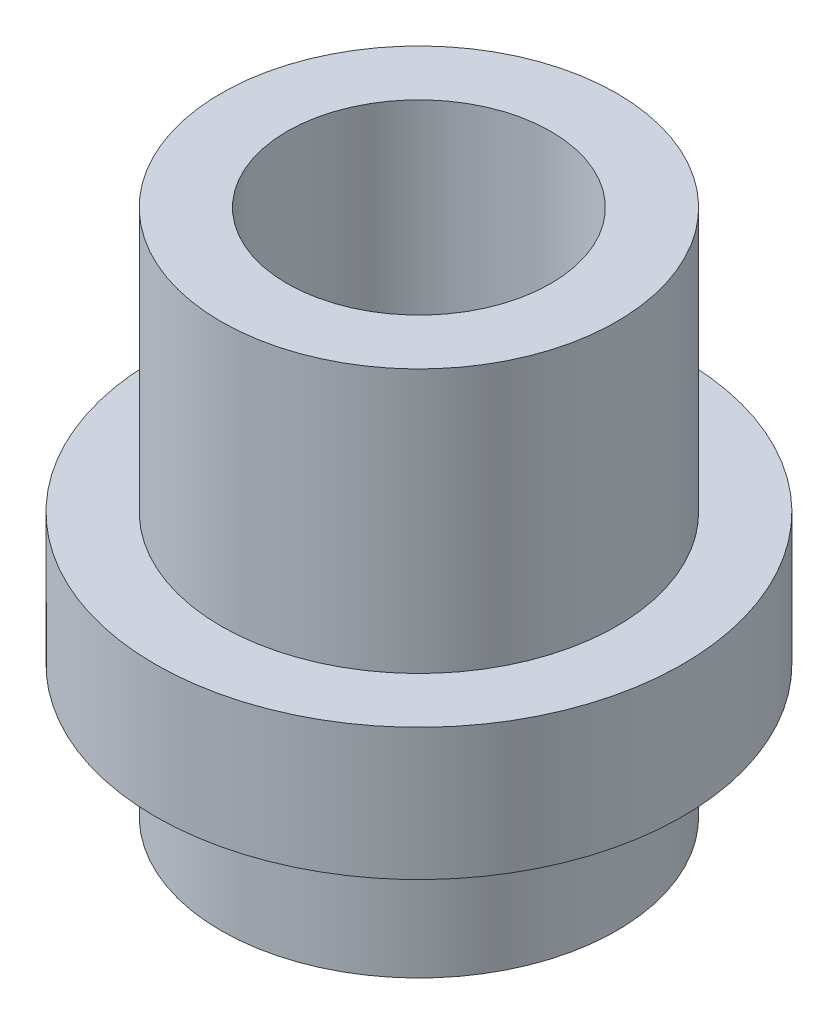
from build123d import *

# Parameters (mm, degrees)
ESQUISSE2_R             = 5
ENL_V_MAT_EXTRU_1_DEPTH = 25.494897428


with BuildPart() as part:
    # Esquisse1 → R_volution1 (revolve)
    with BuildSketch(Plane.XY, mode=Mode.PRIVATE) as r_volution1_sk:
        Polygon((0, 10), (-7.5, 10), (-7.5, 0), (-10, 0), (-10, -5), (-7.5, -5), (-7.5, -10), (0, -10), align=None)
    revolve(r_volution1_sk.sketch.rotate(Axis((0, 11.083743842, 0), (0, -1, 0)), 270), axis=Axis((0, 11.083743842, 0), (0, -1, 0)))

    # Esquisse2 → Enl_v. mat.-Extru.1 (cut, through all)
    with BuildSketch(Plane(origin=(0, 10, 0), x_dir=(1, 0, 0), z_dir=(0, 1, 0))):
        with Locations(Location((0, 0, 0), (0, 0, 270))):
            Circle(ESQUISSE2_R)
    extrude(amount=-ENL_V_MAT_EXTRU_1_DEPTH, mode=Mode.SUBTRACT)


solid = part.part
